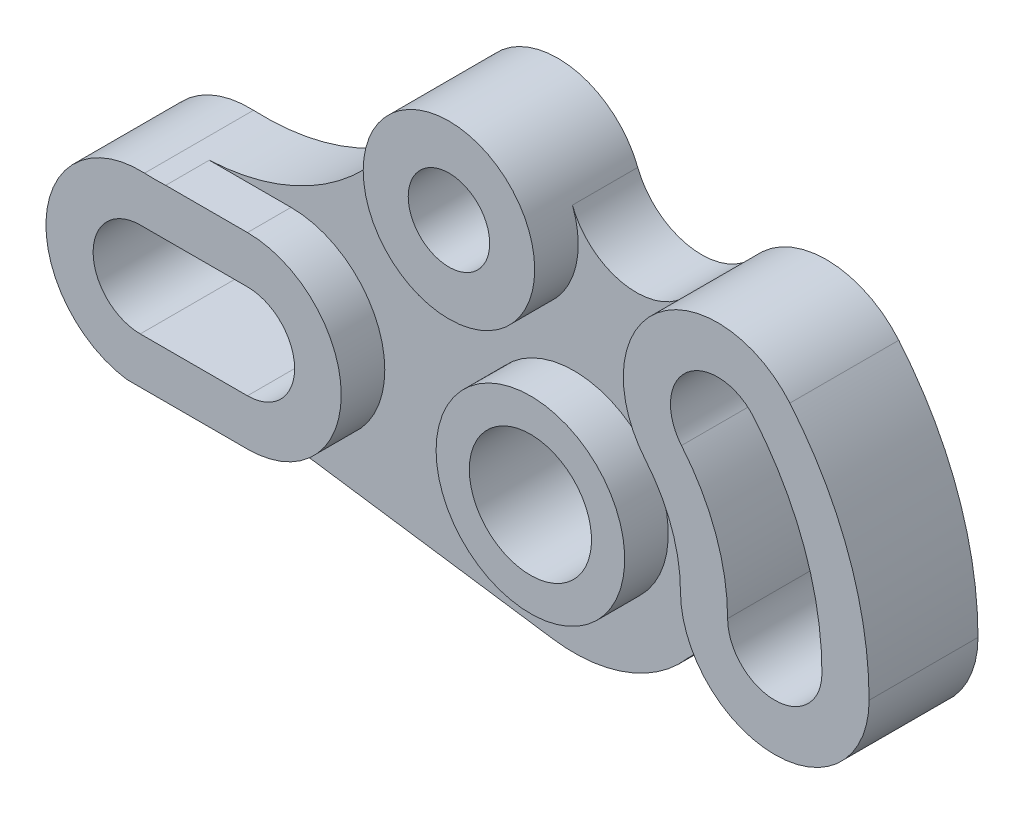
ISO-10303-21;
HEADER;
FILE_DESCRIPTION(('STEP AP214'),'2;1');
FILE_NAME('part.step','',(''),(''),'','','');
FILE_SCHEMA(('AUTOMOTIVE_DESIGN { 1 0 10303 214 1 1 1 1 }'));
ENDSEC;
DATA;
#1=APPLICATION_CONTEXT('core data for automotive mechanical design processes');
#2=APPLICATION_PROTOCOL_DEFINITION('international standard','automotive_design',2000,#1);
#3=PRODUCT_CONTEXT('',#1,'mechanical');
#4=PRODUCT('Part','Part','',(#3));
#5=PRODUCT_RELATED_PRODUCT_CATEGORY('part','',(#4));
#6=PRODUCT_DEFINITION_FORMATION('','',#4);
#7=PRODUCT_DEFINITION_CONTEXT('part definition',#1,'design');
#8=PRODUCT_DEFINITION('design','',#6,#7);
#9=PRODUCT_DEFINITION_SHAPE('','',#8);
#10=(LENGTH_UNIT() NAMED_UNIT(*) SI_UNIT(.MILLI.,.METRE.));
#11=(NAMED_UNIT(*) PLANE_ANGLE_UNIT() SI_UNIT($,.RADIAN.));
#12=(NAMED_UNIT(*) SI_UNIT($,.STERADIAN.) SOLID_ANGLE_UNIT());
#13=UNCERTAINTY_MEASURE_WITH_UNIT(LENGTH_MEASURE(1.E-05),#10,'distance_accuracy_value','');
#14=(GEOMETRIC_REPRESENTATION_CONTEXT(3) GLOBAL_UNCERTAINTY_ASSIGNED_CONTEXT((#13)) GLOBAL_UNIT_ASSIGNED_CONTEXT((#10,
#11,#12)) REPRESENTATION_CONTEXT('',''));
#15=CARTESIAN_POINT('',(0.,0.,0.));
#16=DIRECTION('',(0.,0.,1.));
#17=DIRECTION('',(1.,0.,0.));
#18=AXIS2_PLACEMENT_3D('',#15,#16,#17);
#19=CARTESIAN_POINT('',(-30.0566876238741,119.09206779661,0.));
#20=DIRECTION('',(0.,0.,-1.));
#21=DIRECTION('',(-1.,0.,0.));
#22=AXIS2_PLACEMENT_3D('',#19,#20,#21);
#23=PLANE('',#22);
#24=DIRECTION('',(-1.,0.,0.));
#25=VECTOR('',#24,1.);
#26=CARTESIAN_POINT('',(-30.0566876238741,91.5920677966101,0.));
#27=LINE('',#26,#25);
#28=CARTESIAN_POINT('',(90.5579322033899,91.5920677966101,0.));
#29=VERTEX_POINT('',#28);
#30=CARTESIAN_POINT('',(65.5579322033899,91.5920677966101,0.));
#31=VERTEX_POINT('',#30);
#32=EDGE_CURVE('E232',#29,#31,#27,.T.);
#33=ORIENTED_EDGE('',*,*,#32,.T.);
#34=CARTESIAN_POINT('',(65.5579322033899,102.59206779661,0.));
#35=DIRECTION('',(0.,0.,-1.));
#36=DIRECTION('',(-1.,0.,0.));
#37=AXIS2_PLACEMENT_3D('',#34,#35,#36);
#38=CIRCLE('',#37,11.);
#39=CARTESIAN_POINT('',(65.5579322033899,113.59206779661,0.));
#40=VERTEX_POINT('',#39);
#41=EDGE_CURVE('E235',#31,#40,#38,.T.);
#42=ORIENTED_EDGE('',*,*,#41,.T.);
#43=DIRECTION('',(1.,0.,0.));
#44=VECTOR('',#43,1.);
#45=CARTESIAN_POINT('',(-30.0566876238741,113.59206779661,0.));
#46=LINE('',#45,#44);
#47=CARTESIAN_POINT('',(90.5579322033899,113.59206779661,0.));
#48=VERTEX_POINT('',#47);
#49=EDGE_CURVE('E238',#40,#48,#46,.T.);
#50=ORIENTED_EDGE('',*,*,#49,.T.);
#51=CARTESIAN_POINT('',(90.5579322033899,102.59206779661,0.));
#52=DIRECTION('',(0.,0.,-1.));
#53=DIRECTION('',(-1.,0.,0.));
#54=AXIS2_PLACEMENT_3D('',#51,#52,#53);
#55=CIRCLE('',#54,11.);
#56=EDGE_CURVE('E241',#48,#29,#55,.T.);
#57=ORIENTED_EDGE('',*,*,#56,.T.);
#58=EDGE_LOOP('',(#33,#42,#50,#57));
#59=FACE_BOUND('',#58,.T.);
#60=CARTESIAN_POINT('',(65.5579322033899,102.59206779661,0.));
#61=DIRECTION('',(0.,0.,-1.));
#62=DIRECTION('',(-1.,0.,0.));
#63=AXIS2_PLACEMENT_3D('',#60,#61,#62);
#64=CIRCLE('',#63,22.);
#65=CARTESIAN_POINT('',(62.4150750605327,80.8177147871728,0.));
#66=VERTEX_POINT('',#65);
#67=CARTESIAN_POINT('',(66.5622581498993,124.569131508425,0.));
#68=VERTEX_POINT('',#67);
#69=EDGE_CURVE('E220',#66,#68,#64,.T.);
#70=ORIENTED_EDGE('',*,*,#69,.F.);
#71=DIRECTION('',(-1.,0.,0.));
#72=VECTOR('',#71,1.);
#73=CARTESIAN_POINT('',(-30.0566876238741,80.8177147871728,0.));
#74=LINE('',#73,#72);
#75=CARTESIAN_POINT('',(90.5579322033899,80.8177147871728,0.));
#76=VERTEX_POINT('',#75);
#77=EDGE_CURVE('E412',#76,#66,#74,.T.);
#78=ORIENTED_EDGE('',*,*,#77,.F.);
#79=CARTESIAN_POINT('',(90.5579322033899,102.693423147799,0.));
#80=DIRECTION('',(0.,0.,-1.));
#81=DIRECTION('',(-1.,0.,0.));
#82=AXIS2_PLACEMENT_3D('',#79,#80,#81);
#83=CIRCLE('',#82,21.8757083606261);
#84=CARTESIAN_POINT('',(90.5579322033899,124.569131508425,0.));
#85=VERTEX_POINT('',#84);
#86=EDGE_CURVE('E212',#85,#76,#83,.T.);
#87=ORIENTED_EDGE('',*,*,#86,.F.);
#88=DIRECTION('',(1.,0.,0.));
#89=VECTOR('',#88,1.);
#90=CARTESIAN_POINT('',(-30.0566876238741,124.569131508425,0.));
#91=LINE('',#90,#89);
#92=CARTESIAN_POINT('',(71.4925855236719,124.569131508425,0.));
#93=VERTEX_POINT('',#92);
#94=EDGE_CURVE('E195',#93,#85,#91,.T.);
#95=ORIENTED_EDGE('',*,*,#94,.F.);
#96=CARTESIAN_POINT('',(69.0274218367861,178.512833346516,0.));
#97=DIRECTION('',(0.,0.,-1.));
#98=DIRECTION('',(-1.,0.,0.));
#99=AXIS2_PLACEMENT_3D('',#96,#97,#98);
#100=CIRCLE('',#99,54.);
#101=EDGE_CURVE('E208',#93,#68,#100,.T.);
#102=ORIENTED_EDGE('',*,*,#101,.T.);
#103=EDGE_LOOP('',(#70,#78,#87,#95,#102));
#104=FACE_BOUND('',#103,.T.);
#105=ADVANCED_FACE('F30',(#59,#104),#23,.F.);
#106=CARTESIAN_POINT('',(137.55793220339,150.59206779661,0.));
#107=DIRECTION('',(0.,0.,-1.));
#108=DIRECTION('',(-1.,0.,0.));
#109=AXIS2_PLACEMENT_3D('',#106,#107,#108);
#110=CIRCLE('',#109,9.50000000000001);
#111=CARTESIAN_POINT('',(128.05793220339,150.59206779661,0.));
#112=VERTEX_POINT('',#111);
#113=EDGE_CURVE('E259',#112,#112,#110,.T.);
#114=ORIENTED_EDGE('',*,*,#113,.T.);
#115=EDGE_LOOP('',(#114));
#116=FACE_BOUND('',#115,.T.);
#117=CARTESIAN_POINT('',(137.55793220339,150.59206779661,0.));
#118=DIRECTION('',(0.,0.,-1.));
#119=DIRECTION('',(-1.,0.,0.));
#120=AXIS2_PLACEMENT_3D('',#117,#118,#119);
#121=CIRCLE('',#120,20.);
#122=CARTESIAN_POINT('',(117.55793220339,150.59206779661,0.));
#123=VERTEX_POINT('',#122);
#124=EDGE_CURVE('E221',#123,#123,#121,.T.);
#125=ORIENTED_EDGE('',*,*,#124,.F.);
#126=EDGE_LOOP('',(#125));
#127=FACE_BOUND('',#126,.T.);
#128=ADVANCED_FACE('F463',(#116,#127),#23,.F.);
#129=CARTESIAN_POINT('',(156.55793220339,102.59206779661,0.));
#130=DIRECTION('',(0.,0.,-1.));
#131=DIRECTION('',(-1.,0.,0.));
#132=AXIS2_PLACEMENT_3D('',#129,#130,#131);
#133=CIRCLE('',#132,46.);
#134=CARTESIAN_POINT('',(191.795976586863,132.160297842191,0.));
#135=VERTEX_POINT('',#134);
#136=CARTESIAN_POINT('',(202.55793220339,102.59206779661,0.));
#137=VERTEX_POINT('',#136);
#138=EDGE_CURVE('E247',#135,#137,#133,.T.);
#139=ORIENTED_EDGE('',*,*,#138,.F.);
#140=CARTESIAN_POINT('',(200.222465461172,139.230961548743,0.));
#141=DIRECTION('',(0.,0.,-1.));
#142=DIRECTION('',(-1.,0.,0.));
#143=AXIS2_PLACEMENT_3D('',#140,#141,#142);
#144=CIRCLE('',#143,11.);
#145=CARTESIAN_POINT('',(208.64895433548,146.301625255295,0.));
#146=VERTEX_POINT('',#145);
#147=EDGE_CURVE('E250',#135,#146,#144,.T.);
#148=ORIENTED_EDGE('',*,*,#147,.T.);
#149=CARTESIAN_POINT('',(156.55793220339,102.59206779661,0.));
#150=DIRECTION('',(0.,0.,-1.));
#151=DIRECTION('',(-1.,0.,0.));
#152=AXIS2_PLACEMENT_3D('',#149,#150,#151);
#153=CIRCLE('',#152,68.);
#154=CARTESIAN_POINT('',(224.55793220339,102.59206779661,0.));
#155=VERTEX_POINT('',#154);
#156=EDGE_CURVE('E253',#146,#155,#153,.T.);
#157=ORIENTED_EDGE('',*,*,#156,.T.);
#158=CARTESIAN_POINT('',(213.55793220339,102.59206779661,0.));
#159=DIRECTION('',(0.,0.,-1.));
#160=DIRECTION('',(-1.,0.,0.));
#161=AXIS2_PLACEMENT_3D('',#158,#159,#160);
#162=CIRCLE('',#161,11.);
#163=EDGE_CURVE('E256',#155,#137,#162,.T.);
#164=ORIENTED_EDGE('',*,*,#163,.T.);
#165=EDGE_LOOP('',(#139,#148,#157,#164));
#166=FACE_BOUND('',#165,.T.);
#167=CARTESIAN_POINT('',(156.55793220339,102.59206779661,0.));
#168=DIRECTION('',(0.,0.,-1.));
#169=DIRECTION('',(-1.,0.,0.));
#170=AXIS2_PLACEMENT_3D('',#167,#168,#169);
#171=CIRCLE('',#170,35.);
#172=CARTESIAN_POINT('',(183.369487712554,125.089634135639,0.));
#173=VERTEX_POINT('',#172);
#174=CARTESIAN_POINT('',(191.55793220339,102.59206779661,0.));
#175=VERTEX_POINT('',#174);
#176=EDGE_CURVE('E213',#173,#175,#171,.T.);
#177=ORIENTED_EDGE('',*,*,#176,.T.);
#178=CARTESIAN_POINT('',(213.55793220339,102.59206779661,0.));
#179=DIRECTION('',(0.,0.,-1.));
#180=DIRECTION('',(-1.,0.,0.));
#181=AXIS2_PLACEMENT_3D('',#178,#179,#180);
#182=CIRCLE('',#181,22.);
#183=CARTESIAN_POINT('',(235.55793220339,102.59206779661,0.));
#184=VERTEX_POINT('',#183);
#185=EDGE_CURVE('E223',#184,#175,#182,.T.);
#186=ORIENTED_EDGE('',*,*,#185,.F.);
#187=CARTESIAN_POINT('',(156.55793220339,102.59206779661,0.));
#188=DIRECTION('',(0.,0.,-1.));
#189=DIRECTION('',(-1.,0.,0.));
#190=AXIS2_PLACEMENT_3D('',#187,#188,#189);
#191=CIRCLE('',#190,79.);
#192=CARTESIAN_POINT('',(217.075443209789,153.372288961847,0.));
#193=VERTEX_POINT('',#192);
#194=EDGE_CURVE('E230',#193,#184,#191,.T.);
#195=ORIENTED_EDGE('',*,*,#194,.F.);
#196=CARTESIAN_POINT('',(200.222465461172,139.230961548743,0.));
#197=DIRECTION('',(0.,0.,-1.));
#198=DIRECTION('',(-1.,0.,0.));
#199=AXIS2_PLACEMENT_3D('',#196,#197,#198);
#200=CIRCLE('',#199,22.);
#201=EDGE_CURVE('E47',#173,#193,#200,.T.);
#202=ORIENTED_EDGE('',*,*,#201,.F.);
#203=EDGE_LOOP('',(#177,#186,#195,#202));
#204=FACE_BOUND('',#203,.T.);
#205=ADVANCED_FACE('F418',(#166,#204),#23,.F.);
#206=CARTESIAN_POINT('',(156.55793220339,102.59206779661,-25.4));
#207=DIRECTION('',(0.,0.,1.));
#208=DIRECTION('',(1.,0.,0.));
#209=AXIS2_PLACEMENT_3D('',#206,#207,#208);
#210=CYLINDRICAL_SURFACE('',#209,46.);
#211=ORIENTED_EDGE('',*,*,#138,.T.);
#212=DIRECTION('',(0.,0.,1.));
#213=VECTOR('',#212,1.);
#214=CARTESIAN_POINT('',(202.55793220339,102.59206779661,-25.4));
#215=LINE('',#214,#213);
#216=CARTESIAN_POINT('',(202.55793220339,102.59206779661,-25.4));
#217=VERTEX_POINT('',#216);
#218=EDGE_CURVE('E11',#217,#137,#215,.T.);
#219=ORIENTED_EDGE('',*,*,#218,.F.);
#220=CARTESIAN_POINT('',(156.55793220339,102.59206779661,-25.4));
#221=DIRECTION('',(0.,0.,-1.));
#222=DIRECTION('',(-1.,0.,0.));
#223=AXIS2_PLACEMENT_3D('',#220,#221,#222);
#224=CIRCLE('',#223,46.);
#225=CARTESIAN_POINT('',(191.795976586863,132.160297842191,-25.4));
#226=VERTEX_POINT('',#225);
#227=EDGE_CURVE('E55',#226,#217,#224,.T.);
#228=ORIENTED_EDGE('',*,*,#227,.F.);
#229=DIRECTION('',(0.,0.,1.));
#230=VECTOR('',#229,1.);
#231=CARTESIAN_POINT('',(191.795976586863,132.160297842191,-25.4));
#232=LINE('',#231,#230);
#233=EDGE_CURVE('E316',#226,#135,#232,.T.);
#234=ORIENTED_EDGE('',*,*,#233,.T.);
#235=EDGE_LOOP('',(#211,#219,#228,#234));
#236=FACE_BOUND('',#235,.T.);
#237=ADVANCED_FACE('F483',(#236),#210,.T.);
#238=CARTESIAN_POINT('',(213.55793220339,102.59206779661,-25.4));
#239=DIRECTION('',(0.,0.,1.));
#240=DIRECTION('',(1.,0.,0.));
#241=AXIS2_PLACEMENT_3D('',#238,#239,#240);
#242=CYLINDRICAL_SURFACE('',#241,11.);
#243=ORIENTED_EDGE('',*,*,#163,.F.);
#244=DIRECTION('',(0.,0.,1.));
#245=VECTOR('',#244,1.);
#246=CARTESIAN_POINT('',(224.55793220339,102.59206779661,-25.4));
#247=LINE('',#246,#245);
#248=CARTESIAN_POINT('',(224.55793220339,102.59206779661,-25.4));
#249=VERTEX_POINT('',#248);
#250=EDGE_CURVE('E39',#249,#155,#247,.T.);
#251=ORIENTED_EDGE('',*,*,#250,.F.);
#252=CARTESIAN_POINT('',(213.55793220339,102.59206779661,-25.4));
#253=DIRECTION('',(0.,0.,-1.));
#254=DIRECTION('',(-1.,0.,0.));
#255=AXIS2_PLACEMENT_3D('',#252,#253,#254);
#256=CIRCLE('',#255,11.);
#257=EDGE_CURVE('E307',#249,#217,#256,.T.);
#258=ORIENTED_EDGE('',*,*,#257,.T.);
#259=ORIENTED_EDGE('',*,*,#218,.T.);
#260=EDGE_LOOP('',(#243,#251,#258,#259));
#261=FACE_BOUND('',#260,.T.);
#262=ADVANCED_FACE('F488',(#261),#242,.F.);
#263=CARTESIAN_POINT('',(156.55793220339,102.59206779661,-25.4));
#264=DIRECTION('',(0.,0.,1.));
#265=DIRECTION('',(1.,0.,0.));
#266=AXIS2_PLACEMENT_3D('',#263,#264,#265);
#267=CYLINDRICAL_SURFACE('',#266,68.);
#268=ORIENTED_EDGE('',*,*,#156,.F.);
#269=DIRECTION('',(0.,0.,1.));
#270=VECTOR('',#269,1.);
#271=CARTESIAN_POINT('',(208.64895433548,146.301625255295,-25.4));
#272=LINE('',#271,#270);
#273=CARTESIAN_POINT('',(208.64895433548,146.301625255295,-25.4));
#274=VERTEX_POINT('',#273);
#275=EDGE_CURVE('E314',#274,#146,#272,.T.);
#276=ORIENTED_EDGE('',*,*,#275,.F.);
#277=CARTESIAN_POINT('',(156.55793220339,102.59206779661,-25.4));
#278=DIRECTION('',(0.,0.,-1.));
#279=DIRECTION('',(-1.,0.,0.));
#280=AXIS2_PLACEMENT_3D('',#277,#278,#279);
#281=CIRCLE('',#280,68.);
#282=EDGE_CURVE('E304',#274,#249,#281,.T.);
#283=ORIENTED_EDGE('',*,*,#282,.T.);
#284=ORIENTED_EDGE('',*,*,#250,.T.);
#285=EDGE_LOOP('',(#268,#276,#283,#284));
#286=FACE_BOUND('',#285,.T.);
#287=ADVANCED_FACE('F499',(#286),#267,.F.);
#288=CARTESIAN_POINT('',(-30.0566876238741,91.5920677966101,-25.4));
#289=DIRECTION('',(0.,1.,0.));
#290=DIRECTION('',(0.,0.,1.));
#291=AXIS2_PLACEMENT_3D('',#288,#289,#290);
#292=PLANE('',#291);
#293=ORIENTED_EDGE('',*,*,#32,.F.);
#294=DIRECTION('',(0.,0.,1.));
#295=VECTOR('',#294,1.);
#296=CARTESIAN_POINT('',(90.5579322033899,91.5920677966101,-25.4));
#297=LINE('',#296,#295);
#298=CARTESIAN_POINT('',(90.5579322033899,91.5920677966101,-25.4));
#299=VERTEX_POINT('',#298);
#300=EDGE_CURVE('E318',#299,#29,#297,.T.);
#301=ORIENTED_EDGE('',*,*,#300,.F.);
#302=DIRECTION('',(-1.,0.,0.));
#303=VECTOR('',#302,1.);
#304=CARTESIAN_POINT('',(-30.0566876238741,91.5920677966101,-25.4));
#305=LINE('',#304,#303);
#306=CARTESIAN_POINT('',(65.5579322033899,91.5920677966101,-25.4));
#307=VERTEX_POINT('',#306);
#308=EDGE_CURVE('E285',#299,#307,#305,.T.);
#309=ORIENTED_EDGE('',*,*,#308,.T.);
#310=DIRECTION('',(0.,0.,1.));
#311=VECTOR('',#310,1.);
#312=CARTESIAN_POINT('',(65.5579322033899,91.5920677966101,-25.4));
#313=LINE('',#312,#311);
#314=EDGE_CURVE('E324',#307,#31,#313,.T.);
#315=ORIENTED_EDGE('',*,*,#314,.T.);
#316=EDGE_LOOP('',(#293,#301,#309,#315));
#317=FACE_BOUND('',#316,.T.);
#318=ADVANCED_FACE('F538',(#317),#292,.T.);
#319=CARTESIAN_POINT('',(90.5579322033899,102.59206779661,-25.4));
#320=DIRECTION('',(0.,0.,1.));
#321=DIRECTION('',(1.,0.,0.));
#322=AXIS2_PLACEMENT_3D('',#319,#320,#321);
#323=CYLINDRICAL_SURFACE('',#322,11.);
#324=ORIENTED_EDGE('',*,*,#56,.F.);
#325=DIRECTION('',(0.,0.,1.));
#326=VECTOR('',#325,1.);
#327=CARTESIAN_POINT('',(90.5579322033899,113.59206779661,-25.4));
#328=LINE('',#327,#326);
#329=CARTESIAN_POINT('',(90.5579322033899,113.59206779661,-25.4));
#330=VERTEX_POINT('',#329);
#331=EDGE_CURVE('E320',#330,#48,#328,.T.);
#332=ORIENTED_EDGE('',*,*,#331,.F.);
#333=CARTESIAN_POINT('',(90.5579322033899,102.59206779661,-25.4));
#334=DIRECTION('',(0.,0.,-1.));
#335=DIRECTION('',(-1.,0.,0.));
#336=AXIS2_PLACEMENT_3D('',#333,#334,#335);
#337=CIRCLE('',#336,11.);
#338=EDGE_CURVE('E294',#330,#299,#337,.T.);
#339=ORIENTED_EDGE('',*,*,#338,.T.);
#340=ORIENTED_EDGE('',*,*,#300,.T.);
#341=EDGE_LOOP('',(#324,#332,#339,#340));
#342=FACE_BOUND('',#341,.T.);
#343=ADVANCED_FACE('F541',(#342),#323,.F.);
#344=CARTESIAN_POINT('',(-30.0566876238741,113.59206779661,-25.4));
#345=DIRECTION('',(0.,-1.,0.));
#346=DIRECTION('',(0.,0.,-1.));
#347=AXIS2_PLACEMENT_3D('',#344,#345,#346);
#348=PLANE('',#347);
#349=ORIENTED_EDGE('',*,*,#49,.F.);
#350=DIRECTION('',(0.,0.,1.));
#351=VECTOR('',#350,1.);
#352=CARTESIAN_POINT('',(65.5579322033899,113.59206779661,-25.4));
#353=LINE('',#352,#351);
#354=CARTESIAN_POINT('',(65.5579322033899,113.59206779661,-25.4));
#355=VERTEX_POINT('',#354);
#356=EDGE_CURVE('E322',#355,#40,#353,.T.);
#357=ORIENTED_EDGE('',*,*,#356,.F.);
#358=DIRECTION('',(1.,0.,0.));
#359=VECTOR('',#358,1.);
#360=CARTESIAN_POINT('',(-30.0566876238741,113.59206779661,-25.4));
#361=LINE('',#360,#359);
#362=EDGE_CURVE('E291',#355,#330,#361,.T.);
#363=ORIENTED_EDGE('',*,*,#362,.T.);
#364=ORIENTED_EDGE('',*,*,#331,.T.);
#365=EDGE_LOOP('',(#349,#357,#363,#364));
#366=FACE_BOUND('',#365,.T.);
#367=ADVANCED_FACE('F536',(#366),#348,.T.);
#368=CARTESIAN_POINT('',(200.222465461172,139.230961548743,-25.4));
#369=DIRECTION('',(0.,0.,1.));
#370=DIRECTION('',(1.,0.,0.));
#371=AXIS2_PLACEMENT_3D('',#368,#369,#370);
#372=CYLINDRICAL_SURFACE('',#371,22.);
#373=ORIENTED_EDGE('',*,*,#201,.T.);
#374=DIRECTION('',(0.,0.,1.));
#375=VECTOR('',#374,1.);
#376=CARTESIAN_POINT('',(217.075443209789,153.372288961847,-25.4));
#377=LINE('',#376,#375);
#378=CARTESIAN_POINT('',(217.075443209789,153.372288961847,-25.4));
#379=VERTEX_POINT('',#378);
#380=EDGE_CURVE('E326',#379,#193,#377,.T.);
#381=ORIENTED_EDGE('',*,*,#380,.F.);
#382=CARTESIAN_POINT('',(200.222465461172,139.230961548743,-25.4));
#383=DIRECTION('',(0.,0.,-1.));
#384=DIRECTION('',(-1.,0.,0.));
#385=AXIS2_PLACEMENT_3D('',#382,#383,#384);
#386=CIRCLE('',#385,22.);
#387=CARTESIAN_POINT('',(183.365850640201,153.367953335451,-25.4));
#388=VERTEX_POINT('',#387);
#389=EDGE_CURVE('E262',#388,#379,#386,.T.);
#390=ORIENTED_EDGE('',*,*,#389,.F.);
#391=DIRECTION('',(0.,0.,1.));
#392=VECTOR('',#391,1.);
#393=CARTESIAN_POINT('',(183.365850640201,153.367953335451,-25.4));
#394=LINE('',#393,#392);
#395=CARTESIAN_POINT('',(183.365850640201,153.367953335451,-10.16));
#396=VERTEX_POINT('',#395);
#397=EDGE_CURVE('E34',#388,#396,#394,.T.);
#398=ORIENTED_EDGE('',*,*,#397,.T.);
#399=CARTESIAN_POINT('',(200.222465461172,139.230961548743,-10.16));
#400=DIRECTION('',(0.,0.,-1.));
#401=DIRECTION('',(-1.,0.,0.));
#402=AXIS2_PLACEMENT_3D('',#399,#400,#401);
#403=CIRCLE('',#402,22.);
#404=CARTESIAN_POINT('',(183.369487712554,125.089634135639,-10.16));
#405=VERTEX_POINT('',#404);
#406=EDGE_CURVE('E357',#405,#396,#403,.T.);
#407=ORIENTED_EDGE('',*,*,#406,.F.);
#408=DIRECTION('',(0.,0.,1.));
#409=VECTOR('',#408,1.);
#410=CARTESIAN_POINT('',(183.369487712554,125.089634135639,-10.16));
#411=LINE('',#410,#409);
#412=EDGE_CURVE('E204',#405,#173,#411,.T.);
#413=ORIENTED_EDGE('',*,*,#412,.T.);
#414=EDGE_LOOP('',(#373,#381,#390,#398,#407,#413));
#415=FACE_BOUND('',#414,.T.);
#416=ADVANCED_FACE('F32',(#415),#372,.T.);
#417=CARTESIAN_POINT('',(156.55793220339,102.59206779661,-25.4));
#418=DIRECTION('',(0.,0.,1.));
#419=DIRECTION('',(1.,0.,0.));
#420=AXIS2_PLACEMENT_3D('',#417,#418,#419);
#421=CYLINDRICAL_SURFACE('',#420,79.);
#422=ORIENTED_EDGE('',*,*,#194,.T.);
#423=DIRECTION('',(0.,0.,1.));
#424=VECTOR('',#423,1.);
#425=CARTESIAN_POINT('',(235.55793220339,102.59206779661,-25.4));
#426=LINE('',#425,#424);
#427=CARTESIAN_POINT('',(235.55793220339,102.59206779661,-25.4));
#428=VERTEX_POINT('',#427);
#429=EDGE_CURVE('E329',#428,#184,#426,.T.);
#430=ORIENTED_EDGE('',*,*,#429,.F.);
#431=CARTESIAN_POINT('',(156.55793220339,102.59206779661,-25.4));
#432=DIRECTION('',(0.,0.,-1.));
#433=DIRECTION('',(-1.,0.,0.));
#434=AXIS2_PLACEMENT_3D('',#431,#432,#433);
#435=CIRCLE('',#434,79.);
#436=EDGE_CURVE('E283',#379,#428,#435,.T.);
#437=ORIENTED_EDGE('',*,*,#436,.F.);
#438=ORIENTED_EDGE('',*,*,#380,.T.);
#439=EDGE_LOOP('',(#422,#430,#437,#438));
#440=FACE_BOUND('',#439,.T.);
#441=ADVANCED_FACE('F425',(#440),#421,.T.);
#442=CARTESIAN_POINT('',(213.55793220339,102.59206779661,-25.4));
#443=DIRECTION('',(0.,0.,1.));
#444=DIRECTION('',(1.,0.,0.));
#445=AXIS2_PLACEMENT_3D('',#442,#443,#444);
#446=CYLINDRICAL_SURFACE('',#445,22.);
#447=ORIENTED_EDGE('',*,*,#185,.T.);
#448=DIRECTION('',(0.,0.,1.));
#449=VECTOR('',#448,1.);
#450=CARTESIAN_POINT('',(191.55793220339,102.59206779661,-10.16));
#451=LINE('',#450,#449);
#452=CARTESIAN_POINT('',(191.55793220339,102.59206779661,-10.16));
#453=VERTEX_POINT('',#452);
#454=EDGE_CURVE('E394',#453,#175,#451,.T.);
#455=ORIENTED_EDGE('',*,*,#454,.F.);
#456=CARTESIAN_POINT('',(213.55793220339,102.59206779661,-10.16));
#457=DIRECTION('',(0.,0.,-1.));
#458=DIRECTION('',(-1.,0.,0.));
#459=AXIS2_PLACEMENT_3D('',#456,#457,#458);
#460=CIRCLE('',#459,22.);
#461=CARTESIAN_POINT('',(202.933740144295,83.3274228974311,-10.16));
#462=VERTEX_POINT('',#461);
#463=EDGE_CURVE('E388',#462,#453,#460,.T.);
#464=ORIENTED_EDGE('',*,*,#463,.F.);
#465=DIRECTION('',(0.,0.,1.));
#466=VECTOR('',#465,1.);
#467=CARTESIAN_POINT('',(202.933740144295,83.3274228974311,-25.4));
#468=LINE('',#467,#466);
#469=CARTESIAN_POINT('',(202.933740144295,83.3274228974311,-25.4));
#470=VERTEX_POINT('',#469);
#471=EDGE_CURVE('E332',#470,#462,#468,.T.);
#472=ORIENTED_EDGE('',*,*,#471,.F.);
#473=CARTESIAN_POINT('',(213.55793220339,102.59206779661,-25.4));
#474=DIRECTION('',(0.,0.,-1.));
#475=DIRECTION('',(-1.,0.,0.));
#476=AXIS2_PLACEMENT_3D('',#473,#474,#475);
#477=CIRCLE('',#476,22.);
#478=EDGE_CURVE('E281',#428,#470,#477,.T.);
#479=ORIENTED_EDGE('',*,*,#478,.F.);
#480=ORIENTED_EDGE('',*,*,#429,.T.);
#481=EDGE_LOOP('',(#447,#455,#464,#472,#479,#480));
#482=FACE_BOUND('',#481,.T.);
#483=ADVANCED_FACE('F420',(#482),#446,.T.);
#484=CARTESIAN_POINT('',(195.207055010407,69.3167720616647,-25.4));
#485=DIRECTION('',(0.,0.,1.));
#486=DIRECTION('',(1.,0.,0.));
#487=AXIS2_PLACEMENT_3D('',#484,#485,#486);
#488=CYLINDRICAL_SURFACE('',#487,16.);
#489=CARTESIAN_POINT('',(195.207055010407,69.3167720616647,-10.16));
#490=DIRECTION('',(0.,0.,-1.));
#491=DIRECTION('',(-1.,0.,0.));
#492=AXIS2_PLACEMENT_3D('',#489,#490,#491);
#493=CIRCLE('',#492,16.);
#494=CARTESIAN_POINT('',(183.081840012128,79.7560805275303,-10.16));
#495=VERTEX_POINT('',#494);
#496=EDGE_CURVE('E386',#495,#462,#493,.T.);
#497=ORIENTED_EDGE('',*,*,#496,.F.);
#498=DIRECTION('',(0.,0.,1.));
#499=VECTOR('',#498,1.);
#500=CARTESIAN_POINT('',(183.081840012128,79.7560805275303,-25.4));
#501=LINE('',#500,#499);
#502=CARTESIAN_POINT('',(183.081840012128,79.7560805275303,-25.4));
#503=VERTEX_POINT('',#502);
#504=EDGE_CURVE('E335',#503,#495,#501,.T.);
#505=ORIENTED_EDGE('',*,*,#504,.F.);
#506=CARTESIAN_POINT('',(195.207055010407,69.3167720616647,-25.4));
#507=DIRECTION('',(0.,0.,-1.));
#508=DIRECTION('',(-1.,0.,0.));
#509=AXIS2_PLACEMENT_3D('',#506,#507,#508);
#510=CIRCLE('',#509,16.);
#511=EDGE_CURVE('E278',#503,#470,#510,.T.);
#512=ORIENTED_EDGE('',*,*,#511,.T.);
#513=ORIENTED_EDGE('',*,*,#471,.T.);
#514=EDGE_LOOP('',(#497,#505,#512,#513));
#515=FACE_BOUND('',#514,.T.);
#516=ADVANCED_FACE('F453',(#515),#488,.F.);
#517=CARTESIAN_POINT('',(156.55793220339,102.59206779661,-25.4));
#518=DIRECTION('',(0.,0.,1.));
#519=DIRECTION('',(1.,0.,0.));
#520=AXIS2_PLACEMENT_3D('',#517,#518,#519);
#521=CYLINDRICAL_SURFACE('',#520,34.9999999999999);
#522=ORIENTED_EDGE('',*,*,#504,.T.);
#523=CARTESIAN_POINT('',(156.55793220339,102.59206779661,-10.16));
#524=DIRECTION('',(0.,0.,-1.));
#525=DIRECTION('',(-1.,0.,0.));
#526=AXIS2_PLACEMENT_3D('',#523,#524,#525);
#527=CIRCLE('',#526,34.9999999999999);
#528=CARTESIAN_POINT('',(151.55793220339,67.9510516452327,-10.16));
#529=VERTEX_POINT('',#528);
#530=EDGE_CURVE('E383',#495,#529,#527,.T.);
#531=ORIENTED_EDGE('',*,*,#530,.T.);
#532=DIRECTION('',(0.,0.,1.));
#533=VECTOR('',#532,1.);
#534=CARTESIAN_POINT('',(151.55793220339,67.9510516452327,-25.4));
#535=LINE('',#534,#533);
#536=CARTESIAN_POINT('',(151.55793220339,67.9510516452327,-25.4));
#537=VERTEX_POINT('',#536);
#538=EDGE_CURVE('E338',#537,#529,#535,.T.);
#539=ORIENTED_EDGE('',*,*,#538,.F.);
#540=CARTESIAN_POINT('',(156.55793220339,102.59206779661,-25.4));
#541=DIRECTION('',(0.,0.,-1.));
#542=DIRECTION('',(-1.,0.,0.));
#543=AXIS2_PLACEMENT_3D('',#540,#541,#542);
#544=CIRCLE('',#543,34.9999999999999);
#545=EDGE_CURVE('E276',#503,#537,#544,.T.);
#546=ORIENTED_EDGE('',*,*,#545,.F.);
#547=EDGE_LOOP('',(#522,#531,#539,#546));
#548=FACE_BOUND('',#547,.T.);
#549=ADVANCED_FACE('F449',(#548),#521,.T.);
#550=CARTESIAN_POINT('',(-33.5811923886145,94.6735825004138,-25.4));
#551=DIRECTION('',(0.142857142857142,0.989743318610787,0.));
#552=DIRECTION('',(-0.989743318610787,0.142857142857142,0.));
#553=AXIS2_PLACEMENT_3D('',#550,#551,#552);
#554=PLANE('',#553);
#555=ORIENTED_EDGE('',*,*,#538,.T.);
#556=DIRECTION('',(-0.989743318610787,0.142857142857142,0.));
#557=VECTOR('',#556,1.);
#558=CARTESIAN_POINT('',(-33.5811923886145,94.6735825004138,-10.16));
#559=LINE('',#558,#557);
#560=CARTESIAN_POINT('',(62.4150750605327,80.8177147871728,-10.16));
#561=VERTEX_POINT('',#560);
#562=EDGE_CURVE('E380',#529,#561,#559,.T.);
#563=ORIENTED_EDGE('',*,*,#562,.T.);
#564=DIRECTION('',(0.,0.,1.));
#565=VECTOR('',#564,1.);
#566=CARTESIAN_POINT('',(62.4150750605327,80.8177147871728,-25.4));
#567=LINE('',#566,#565);
#568=CARTESIAN_POINT('',(62.4150750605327,80.8177147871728,-25.4));
#569=VERTEX_POINT('',#568);
#570=EDGE_CURVE('E341',#569,#561,#567,.T.);
#571=ORIENTED_EDGE('',*,*,#570,.F.);
#572=DIRECTION('',(-0.989743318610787,0.142857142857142,0.));
#573=VECTOR('',#572,1.);
#574=CARTESIAN_POINT('',(-33.5811923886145,94.6735825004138,-25.4));
#575=LINE('',#574,#573);
#576=EDGE_CURVE('E274',#537,#569,#575,.T.);
#577=ORIENTED_EDGE('',*,*,#576,.F.);
#578=EDGE_LOOP('',(#555,#563,#571,#577));
#579=FACE_BOUND('',#578,.T.);
#580=ADVANCED_FACE('F445',(#579),#554,.F.);
#581=CARTESIAN_POINT('',(65.5579322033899,102.59206779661,-25.4));
#582=DIRECTION('',(0.,0.,1.));
#583=DIRECTION('',(1.,0.,0.));
#584=AXIS2_PLACEMENT_3D('',#581,#582,#583);
#585=CYLINDRICAL_SURFACE('',#584,22.);
#586=ORIENTED_EDGE('',*,*,#69,.T.);
#587=DIRECTION('',(0.,0.,1.));
#588=VECTOR('',#587,1.);
#589=CARTESIAN_POINT('',(66.5622581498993,124.569131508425,-25.4));
#590=LINE('',#589,#588);
#591=CARTESIAN_POINT('',(66.5622581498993,124.569131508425,-25.4));
#592=VERTEX_POINT('',#591);
#593=EDGE_CURVE('E218',#592,#68,#590,.T.);
#594=ORIENTED_EDGE('',*,*,#593,.F.);
#595=CARTESIAN_POINT('',(65.5579322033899,102.59206779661,-25.4));
#596=DIRECTION('',(0.,0.,-1.));
#597=DIRECTION('',(-1.,0.,0.));
#598=AXIS2_PLACEMENT_3D('',#595,#596,#597);
#599=CIRCLE('',#598,22.);
#600=EDGE_CURVE('E272',#569,#592,#599,.T.);
#601=ORIENTED_EDGE('',*,*,#600,.F.);
#602=ORIENTED_EDGE('',*,*,#570,.T.);
#603=DIRECTION('',(0.,0.,1.));
#604=VECTOR('',#603,1.);
#605=CARTESIAN_POINT('',(62.4150750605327,80.8177147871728,-10.16));
#606=LINE('',#605,#604);
#607=EDGE_CURVE('E397',#561,#66,#606,.T.);
#608=ORIENTED_EDGE('',*,*,#607,.T.);
#609=EDGE_LOOP('',(#586,#594,#601,#602,#608));
#610=FACE_BOUND('',#609,.T.);
#611=ADVANCED_FACE('F440',(#610),#585,.T.);
#612=CARTESIAN_POINT('',(69.0274218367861,178.512833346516,-25.4));
#613=DIRECTION('',(0.,0.,1.));
#614=DIRECTION('',(1.,0.,0.));
#615=AXIS2_PLACEMENT_3D('',#612,#613,#614);
#616=CYLINDRICAL_SURFACE('',#615,54.);
#617=DIRECTION('',(0.,0.,1.));
#618=VECTOR('',#617,1.);
#619=CARTESIAN_POINT('',(71.4925855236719,124.569131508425,-10.16));
#620=LINE('',#619,#618);
#621=CARTESIAN_POINT('',(71.4925855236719,124.569131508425,-10.16));
#622=VERTEX_POINT('',#621);
#623=EDGE_CURVE('E192',#622,#93,#620,.T.);
#624=ORIENTED_EDGE('',*,*,#623,.F.);
#625=CARTESIAN_POINT('',(69.0274218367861,178.512833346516,-10.16));
#626=DIRECTION('',(0.,0.,-1.));
#627=DIRECTION('',(-1.,0.,0.));
#628=AXIS2_PLACEMENT_3D('',#625,#626,#627);
#629=CIRCLE('',#628,54.);
#630=CARTESIAN_POINT('',(119.036172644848,158.138220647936,-10.16));
#631=VERTEX_POINT('',#630);
#632=EDGE_CURVE('E366',#631,#622,#629,.T.);
#633=ORIENTED_EDGE('',*,*,#632,.F.);
#634=DIRECTION('',(0.,0.,1.));
#635=VECTOR('',#634,1.);
#636=CARTESIAN_POINT('',(119.036172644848,158.138220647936,-25.4));
#637=LINE('',#636,#635);
#638=CARTESIAN_POINT('',(119.036172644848,158.138220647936,-25.4));
#639=VERTEX_POINT('',#638);
#640=EDGE_CURVE('E345',#639,#631,#637,.T.);
#641=ORIENTED_EDGE('',*,*,#640,.F.);
#642=CARTESIAN_POINT('',(69.0274218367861,178.512833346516,-25.4));
#643=DIRECTION('',(0.,0.,-1.));
#644=DIRECTION('',(-1.,0.,0.));
#645=AXIS2_PLACEMENT_3D('',#642,#643,#644);
#646=CIRCLE('',#645,54.);
#647=EDGE_CURVE('E270',#639,#592,#646,.T.);
#648=ORIENTED_EDGE('',*,*,#647,.T.);
#649=ORIENTED_EDGE('',*,*,#593,.T.);
#650=ORIENTED_EDGE('',*,*,#101,.F.);
#651=EDGE_LOOP('',(#624,#633,#641,#648,#649,#650));
#652=FACE_BOUND('',#651,.T.);
#653=ADVANCED_FACE('F215',(#652),#616,.F.);
#654=CARTESIAN_POINT('',(137.55793220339,150.59206779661,-25.4));
#655=DIRECTION('',(0.,0.,1.));
#656=DIRECTION('',(1.,0.,0.));
#657=AXIS2_PLACEMENT_3D('',#654,#655,#656);
#658=CYLINDRICAL_SURFACE('',#657,20.);
#659=ORIENTED_EDGE('',*,*,#124,.T.);
#660=EDGE_LOOP('',(#659));
#661=FACE_BOUND('',#660,.T.);
#662=ORIENTED_EDGE('',*,*,#640,.T.);
#663=CARTESIAN_POINT('',(137.55793220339,150.59206779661,-10.16));
#664=DIRECTION('',(0.,0.,-1.));
#665=DIRECTION('',(-1.,0.,0.));
#666=AXIS2_PLACEMENT_3D('',#663,#664,#665);
#667=CIRCLE('',#666,20.);
#668=CARTESIAN_POINT('',(156.196022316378,157.846142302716,-10.16));
#669=VERTEX_POINT('',#668);
#670=EDGE_CURVE('E364',#669,#631,#667,.T.);
#671=ORIENTED_EDGE('',*,*,#670,.F.);
#672=DIRECTION('',(0.,0.,1.));
#673=VECTOR('',#672,1.);
#674=CARTESIAN_POINT('',(156.196022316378,157.846142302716,-25.4));
#675=LINE('',#674,#673);
#676=CARTESIAN_POINT('',(156.196022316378,157.846142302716,-25.4));
#677=VERTEX_POINT('',#676);
#678=EDGE_CURVE('E347',#677,#669,#675,.T.);
#679=ORIENTED_EDGE('',*,*,#678,.F.);
#680=CARTESIAN_POINT('',(137.55793220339,150.59206779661,-25.4));
#681=DIRECTION('',(0.,0.,-1.));
#682=DIRECTION('',(-1.,0.,0.));
#683=AXIS2_PLACEMENT_3D('',#680,#681,#682);
#684=CIRCLE('',#683,20.);
#685=EDGE_CURVE('E268',#639,#677,#684,.T.);
#686=ORIENTED_EDGE('',*,*,#685,.F.);
#687=EDGE_LOOP('',(#662,#671,#679,#686));
#688=FACE_BOUND('',#687,.T.);
#689=ADVANCED_FACE('F432',(#661,#688),#658,.T.);
#690=CARTESIAN_POINT('',(200.222465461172,139.230961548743,-25.4));
#691=DIRECTION('',(0.,0.,1.));
#692=DIRECTION('',(1.,0.,0.));
#693=AXIS2_PLACEMENT_3D('',#690,#691,#692);
#694=CYLINDRICAL_SURFACE('',#693,11.);
#695=ORIENTED_EDGE('',*,*,#147,.F.);
#696=ORIENTED_EDGE('',*,*,#233,.F.);
#697=CARTESIAN_POINT('',(200.222465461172,139.230961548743,-25.4));
#698=DIRECTION('',(0.,0.,-1.));
#699=DIRECTION('',(-1.,0.,0.));
#700=AXIS2_PLACEMENT_3D('',#697,#698,#699);
#701=CIRCLE('',#700,11.);
#702=EDGE_CURVE('E301',#226,#274,#701,.T.);
#703=ORIENTED_EDGE('',*,*,#702,.T.);
#704=ORIENTED_EDGE('',*,*,#275,.T.);
#705=EDGE_LOOP('',(#695,#696,#703,#704));
#706=FACE_BOUND('',#705,.T.);
#707=ADVANCED_FACE('F495',(#706),#694,.F.);
#708=CARTESIAN_POINT('',(156.55793220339,102.59206779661,-25.4));
#709=DIRECTION('',(0.,0.,1.));
#710=DIRECTION('',(1.,0.,0.));
#711=AXIS2_PLACEMENT_3D('',#708,#709,#710);
#712=CYLINDRICAL_SURFACE('',#711,14.25);
#713=CARTESIAN_POINT('',(156.55793220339,102.59206779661,-25.4));
#714=DIRECTION('',(0.,0.,-1.));
#715=DIRECTION('',(-1.,0.,0.));
#716=AXIS2_PLACEMENT_3D('',#713,#714,#715);
#717=CIRCLE('',#716,14.25);
#718=CARTESIAN_POINT('',(142.30793220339,102.59206779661,-25.4));
#719=VERTEX_POINT('',#718);
#720=EDGE_CURVE('E297',#719,#719,#717,.T.);
#721=ORIENTED_EDGE('',*,*,#720,.T.);
#722=EDGE_LOOP('',(#721));
#723=FACE_BOUND('',#722,.T.);
#724=CARTESIAN_POINT('',(156.55793220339,102.59206779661,0.));
#725=DIRECTION('',(0.,0.,-1.));
#726=DIRECTION('',(-1.,0.,0.));
#727=AXIS2_PLACEMENT_3D('',#724,#725,#726);
#728=CIRCLE('',#727,14.25);
#729=CARTESIAN_POINT('',(142.30793220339,102.59206779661,0.));
#730=VERTEX_POINT('',#729);
#731=EDGE_CURVE('E244',#730,#730,#728,.T.);
#732=ORIENTED_EDGE('',*,*,#731,.F.);
#733=EDGE_LOOP('',(#732));
#734=FACE_BOUND('',#733,.T.);
#735=ADVANCED_FACE('F517',(#723,#734),#712,.F.);
#736=CARTESIAN_POINT('',(65.5579322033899,102.59206779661,-25.4));
#737=DIRECTION('',(0.,0.,1.));
#738=DIRECTION('',(1.,0.,0.));
#739=AXIS2_PLACEMENT_3D('',#736,#737,#738);
#740=CYLINDRICAL_SURFACE('',#739,11.);
#741=ORIENTED_EDGE('',*,*,#41,.F.);
#742=ORIENTED_EDGE('',*,*,#314,.F.);
#743=CARTESIAN_POINT('',(65.5579322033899,102.59206779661,-25.4));
#744=DIRECTION('',(0.,0.,-1.));
#745=DIRECTION('',(-1.,0.,0.));
#746=AXIS2_PLACEMENT_3D('',#743,#744,#745);
#747=CIRCLE('',#746,11.);
#748=EDGE_CURVE('E288',#307,#355,#747,.T.);
#749=ORIENTED_EDGE('',*,*,#748,.T.);
#750=ORIENTED_EDGE('',*,*,#356,.T.);
#751=EDGE_LOOP('',(#741,#742,#749,#750));
#752=FACE_BOUND('',#751,.T.);
#753=ADVANCED_FACE('F522',(#752),#740,.F.);
#754=CARTESIAN_POINT('',(171.106494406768,163.649401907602,-25.4));
#755=DIRECTION('',(0.,0.,1.));
#756=DIRECTION('',(1.,0.,0.));
#757=AXIS2_PLACEMENT_3D('',#754,#755,#756);
#758=CYLINDRICAL_SURFACE('',#757,16.);
#759=CARTESIAN_POINT('',(171.106494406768,163.649401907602,-10.16));
#760=DIRECTION('',(0.,0.,-1.));
#761=DIRECTION('',(-1.,0.,0.));
#762=AXIS2_PLACEMENT_3D('',#759,#760,#761);
#763=CIRCLE('',#762,16.);
#764=EDGE_CURVE('E362',#396,#669,#763,.T.);
#765=ORIENTED_EDGE('',*,*,#764,.F.);
#766=ORIENTED_EDGE('',*,*,#397,.F.);
#767=CARTESIAN_POINT('',(171.106494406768,163.649401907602,-25.4));
#768=DIRECTION('',(0.,0.,-1.));
#769=DIRECTION('',(-1.,0.,0.));
#770=AXIS2_PLACEMENT_3D('',#767,#768,#769);
#771=CIRCLE('',#770,16.);
#772=EDGE_CURVE('E265',#388,#677,#771,.T.);
#773=ORIENTED_EDGE('',*,*,#772,.T.);
#774=ORIENTED_EDGE('',*,*,#678,.T.);
#775=EDGE_LOOP('',(#765,#766,#773,#774));
#776=FACE_BOUND('',#775,.T.);
#777=ADVANCED_FACE('F360',(#776),#758,.F.);
#778=CARTESIAN_POINT('',(137.55793220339,150.59206779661,-25.4));
#779=DIRECTION('',(0.,0.,1.));
#780=DIRECTION('',(1.,0.,0.));
#781=AXIS2_PLACEMENT_3D('',#778,#779,#780);
#782=CYLINDRICAL_SURFACE('',#781,9.50000000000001);
#783=CARTESIAN_POINT('',(137.55793220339,150.59206779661,-25.4));
#784=DIRECTION('',(0.,0.,-1.));
#785=DIRECTION('',(-1.,0.,0.));
#786=AXIS2_PLACEMENT_3D('',#783,#784,#785);
#787=CIRCLE('',#786,9.50000000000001);
#788=CARTESIAN_POINT('',(128.05793220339,150.59206779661,-25.4));
#789=VERTEX_POINT('',#788);
#790=EDGE_CURVE('E310',#789,#789,#787,.T.);
#791=ORIENTED_EDGE('',*,*,#790,.T.);
#792=EDGE_LOOP('',(#791));
#793=FACE_BOUND('',#792,.T.);
#794=ORIENTED_EDGE('',*,*,#113,.F.);
#795=EDGE_LOOP('',(#794));
#796=FACE_BOUND('',#795,.T.);
#797=ADVANCED_FACE('F479',(#793,#796),#782,.F.);
#798=CARTESIAN_POINT('',(-30.0566876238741,119.09206779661,-25.4));
#799=DIRECTION('',(0.,0.,-1.));
#800=DIRECTION('',(-1.,0.,0.));
#801=AXIS2_PLACEMENT_3D('',#798,#799,#800);
#802=PLANE('',#801);
#803=ORIENTED_EDGE('',*,*,#389,.T.);
#804=ORIENTED_EDGE('',*,*,#436,.T.);
#805=ORIENTED_EDGE('',*,*,#478,.T.);
#806=ORIENTED_EDGE('',*,*,#511,.F.);
#807=ORIENTED_EDGE('',*,*,#545,.T.);
#808=ORIENTED_EDGE('',*,*,#576,.T.);
#809=ORIENTED_EDGE('',*,*,#600,.T.);
#810=ORIENTED_EDGE('',*,*,#647,.F.);
#811=ORIENTED_EDGE('',*,*,#685,.T.);
#812=ORIENTED_EDGE('',*,*,#772,.F.);
#813=EDGE_LOOP('',(#803,#804,#805,#806,#807,#808,#809,#810,#811,#812));
#814=FACE_BOUND('',#813,.T.);
#815=ORIENTED_EDGE('',*,*,#308,.F.);
#816=ORIENTED_EDGE('',*,*,#338,.F.);
#817=ORIENTED_EDGE('',*,*,#362,.F.);
#818=ORIENTED_EDGE('',*,*,#748,.F.);
#819=EDGE_LOOP('',(#815,#816,#817,#818));
#820=FACE_BOUND('',#819,.T.);
#821=ORIENTED_EDGE('',*,*,#720,.F.);
#822=EDGE_LOOP('',(#821));
#823=FACE_BOUND('',#822,.T.);
#824=ORIENTED_EDGE('',*,*,#227,.T.);
#825=ORIENTED_EDGE('',*,*,#257,.F.);
#826=ORIENTED_EDGE('',*,*,#282,.F.);
#827=ORIENTED_EDGE('',*,*,#702,.F.);
#828=EDGE_LOOP('',(#824,#825,#826,#827));
#829=FACE_BOUND('',#828,.T.);
#830=ORIENTED_EDGE('',*,*,#790,.F.);
#831=EDGE_LOOP('',(#830));
#832=FACE_BOUND('',#831,.T.);
#833=ADVANCED_FACE('F427',(#814,#820,#823,#829,#832),#802,.T.);
#834=CARTESIAN_POINT('',(156.55793220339,102.59206779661,0.));
#835=DIRECTION('',(0.,0.,-1.));
#836=DIRECTION('',(-1.,0.,0.));
#837=AXIS2_PLACEMENT_3D('',#834,#835,#836);
#838=CIRCLE('',#837,22.);
#839=CARTESIAN_POINT('',(134.55793220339,102.59206779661,0.));
#840=VERTEX_POINT('',#839);
#841=EDGE_CURVE('E410',#840,#840,#838,.T.);
#842=ORIENTED_EDGE('',*,*,#841,.F.);
#843=EDGE_LOOP('',(#842));
#844=FACE_BOUND('',#843,.T.);
#845=ORIENTED_EDGE('',*,*,#731,.T.);
#846=EDGE_LOOP('',(#845));
#847=FACE_BOUND('',#846,.T.);
#848=ADVANCED_FACE('F466',(#844,#847),#23,.F.);
#849=CARTESIAN_POINT('',(156.55793220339,102.59206779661,-10.16));
#850=DIRECTION('',(0.,0.,1.));
#851=DIRECTION('',(1.,0.,0.));
#852=AXIS2_PLACEMENT_3D('',#849,#850,#851);
#853=CYLINDRICAL_SURFACE('',#852,35.);
#854=ORIENTED_EDGE('',*,*,#176,.F.);
#855=ORIENTED_EDGE('',*,*,#412,.F.);
#856=CARTESIAN_POINT('',(156.55793220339,102.59206779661,-10.16));
#857=DIRECTION('',(0.,0.,-1.));
#858=DIRECTION('',(-1.,0.,0.));
#859=AXIS2_PLACEMENT_3D('',#856,#857,#858);
#860=CIRCLE('',#859,35.);
#861=EDGE_CURVE('E368',#405,#453,#860,.T.);
#862=ORIENTED_EDGE('',*,*,#861,.T.);
#863=ORIENTED_EDGE('',*,*,#454,.T.);
#864=EDGE_LOOP('',(#854,#855,#862,#863));
#865=FACE_BOUND('',#864,.T.);
#866=ADVANCED_FACE('F405',(#865),#853,.F.);
#867=CARTESIAN_POINT('',(-30.0566876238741,80.8177147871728,-10.16));
#868=DIRECTION('',(0.,1.,0.));
#869=DIRECTION('',(0.,0.,1.));
#870=AXIS2_PLACEMENT_3D('',#867,#868,#869);
#871=PLANE('',#870);
#872=ORIENTED_EDGE('',*,*,#77,.T.);
#873=ORIENTED_EDGE('',*,*,#607,.F.);
#874=DIRECTION('',(-1.,0.,0.));
#875=VECTOR('',#874,1.);
#876=CARTESIAN_POINT('',(-30.0566876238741,80.8177147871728,-10.16));
#877=LINE('',#876,#875);
#878=CARTESIAN_POINT('',(90.5579322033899,80.8177147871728,-10.16));
#879=VERTEX_POINT('',#878);
#880=EDGE_CURVE('E377',#879,#561,#877,.T.);
#881=ORIENTED_EDGE('',*,*,#880,.F.);
#882=DIRECTION('',(0.,0.,1.));
#883=VECTOR('',#882,1.);
#884=CARTESIAN_POINT('',(90.5579322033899,80.8177147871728,-10.16));
#885=LINE('',#884,#883);
#886=EDGE_CURVE('E400',#879,#76,#885,.T.);
#887=ORIENTED_EDGE('',*,*,#886,.T.);
#888=EDGE_LOOP('',(#872,#873,#881,#887));
#889=FACE_BOUND('',#888,.T.);
#890=ADVANCED_FACE('F438',(#889),#871,.F.);
#891=CARTESIAN_POINT('',(90.5579322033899,102.693423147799,-10.16));
#892=DIRECTION('',(0.,0.,1.));
#893=DIRECTION('',(1.,0.,0.));
#894=AXIS2_PLACEMENT_3D('',#891,#892,#893);
#895=CYLINDRICAL_SURFACE('',#894,21.8757083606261);
#896=ORIENTED_EDGE('',*,*,#86,.T.);
#897=ORIENTED_EDGE('',*,*,#886,.F.);
#898=CARTESIAN_POINT('',(90.5579322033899,102.693423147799,-10.16));
#899=DIRECTION('',(0.,0.,-1.));
#900=DIRECTION('',(-1.,0.,0.));
#901=AXIS2_PLACEMENT_3D('',#898,#899,#900);
#902=CIRCLE('',#901,21.8757083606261);
#903=CARTESIAN_POINT('',(90.5579322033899,124.569131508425,-10.16));
#904=VERTEX_POINT('',#903);
#905=EDGE_CURVE('E374',#904,#879,#902,.T.);
#906=ORIENTED_EDGE('',*,*,#905,.F.);
#907=DIRECTION('',(0.,0.,1.));
#908=VECTOR('',#907,1.);
#909=CARTESIAN_POINT('',(90.5579322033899,124.569131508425,-10.16));
#910=LINE('',#909,#908);
#911=EDGE_CURVE('E203',#904,#85,#910,.T.);
#912=ORIENTED_EDGE('',*,*,#911,.T.);
#913=EDGE_LOOP('',(#896,#897,#906,#912));
#914=FACE_BOUND('',#913,.T.);
#915=ADVANCED_FACE('F436',(#914),#895,.T.);
#916=CARTESIAN_POINT('',(-30.0566876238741,124.569131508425,-10.16));
#917=DIRECTION('',(0.,-1.,0.));
#918=DIRECTION('',(0.,0.,-1.));
#919=AXIS2_PLACEMENT_3D('',#916,#917,#918);
#920=PLANE('',#919);
#921=ORIENTED_EDGE('',*,*,#94,.T.);
#922=ORIENTED_EDGE('',*,*,#911,.F.);
#923=DIRECTION('',(1.,0.,0.));
#924=VECTOR('',#923,1.);
#925=CARTESIAN_POINT('',(-30.0566876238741,124.569131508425,-10.16));
#926=LINE('',#925,#924);
#927=EDGE_CURVE('E198',#622,#904,#926,.T.);
#928=ORIENTED_EDGE('',*,*,#927,.F.);
#929=ORIENTED_EDGE('',*,*,#623,.T.);
#930=EDGE_LOOP('',(#921,#922,#928,#929));
#931=FACE_BOUND('',#930,.T.);
#932=ADVANCED_FACE('F194',(#931),#920,.F.);
#933=CARTESIAN_POINT('',(156.55793220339,102.59206779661,-10.16));
#934=DIRECTION('',(0.,0.,1.));
#935=DIRECTION('',(1.,0.,0.));
#936=AXIS2_PLACEMENT_3D('',#933,#934,#935);
#937=CYLINDRICAL_SURFACE('',#936,22.);
#938=CARTESIAN_POINT('',(156.55793220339,102.59206779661,-10.16));
#939=DIRECTION('',(0.,0.,-1.));
#940=DIRECTION('',(-1.,0.,0.));
#941=AXIS2_PLACEMENT_3D('',#938,#939,#940);
#942=CIRCLE('',#941,22.);
#943=CARTESIAN_POINT('',(134.55793220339,102.59206779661,-10.16));
#944=VERTEX_POINT('',#943);
#945=EDGE_CURVE('E391',#944,#944,#942,.T.);
#946=ORIENTED_EDGE('',*,*,#945,.F.);
#947=EDGE_LOOP('',(#946));
#948=FACE_BOUND('',#947,.T.);
#949=ORIENTED_EDGE('',*,*,#841,.T.);
#950=EDGE_LOOP('',(#949));
#951=FACE_BOUND('',#950,.T.);
#952=ADVANCED_FACE('F740',(#948,#951),#937,.T.);
#953=CARTESIAN_POINT('',(-30.0566876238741,119.09206779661,-10.16));
#954=DIRECTION('',(0.,0.,-1.));
#955=DIRECTION('',(-1.,0.,0.));
#956=AXIS2_PLACEMENT_3D('',#953,#954,#955);
#957=PLANE('',#956);
#958=ORIENTED_EDGE('',*,*,#861,.F.);
#959=ORIENTED_EDGE('',*,*,#406,.T.);
#960=ORIENTED_EDGE('',*,*,#764,.T.);
#961=ORIENTED_EDGE('',*,*,#670,.T.);
#962=ORIENTED_EDGE('',*,*,#632,.T.);
#963=ORIENTED_EDGE('',*,*,#927,.T.);
#964=ORIENTED_EDGE('',*,*,#905,.T.);
#965=ORIENTED_EDGE('',*,*,#880,.T.);
#966=ORIENTED_EDGE('',*,*,#562,.F.);
#967=ORIENTED_EDGE('',*,*,#530,.F.);
#968=ORIENTED_EDGE('',*,*,#496,.T.);
#969=ORIENTED_EDGE('',*,*,#463,.T.);
#970=EDGE_LOOP('',(#958,#959,#960,#961,#962,#963,#964,#965,#966,#967,#968,#969));
#971=FACE_BOUND('',#970,.T.);
#972=ORIENTED_EDGE('',*,*,#945,.T.);
#973=EDGE_LOOP('',(#972));
#974=FACE_BOUND('',#973,.T.);
#975=ADVANCED_FACE('F407',(#971,#974),#957,.F.);
#976=CLOSED_SHELL('',(#105,#128,#205,#237,#262,#287,#318,#343,#367,#416,#441,#483,#516,#549,
#580,#611,#653,#689,#707,#735,#753,#777,#797,#833,#848,#866,#890,#915,#932,#952,#975));
#977=MANIFOLD_SOLID_BREP('B2',#976);
#978=ADVANCED_BREP_SHAPE_REPRESENTATION('',(#18,#977),#14);
#979=SHAPE_DEFINITION_REPRESENTATION(#9,#978);
ENDSEC;
END-ISO-10303-21;
